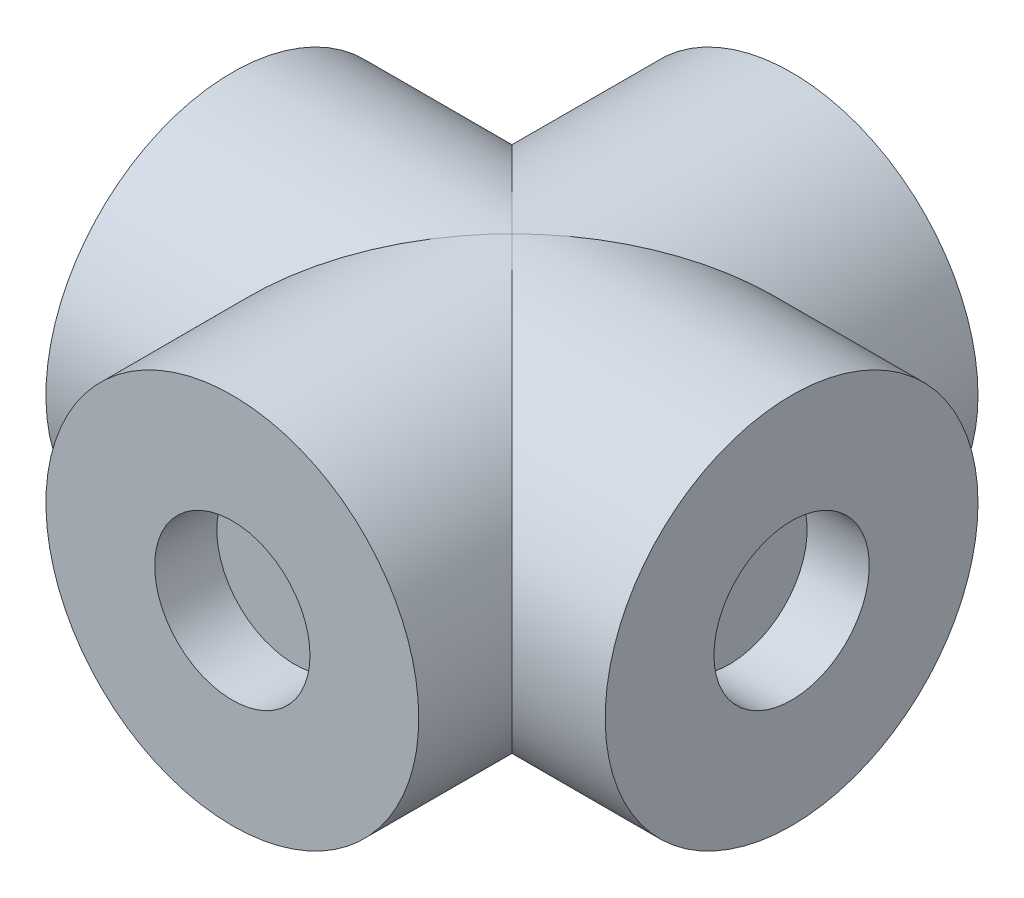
ISO-10303-21;
HEADER;
FILE_DESCRIPTION(('STEP AP214'),'2;1');
FILE_NAME('part.step','',(''),(''),'','','');
FILE_SCHEMA(('AUTOMOTIVE_DESIGN { 1 0 10303 214 1 1 1 1 }'));
ENDSEC;
DATA;
#1=APPLICATION_CONTEXT('core data for automotive mechanical design processes');
#2=APPLICATION_PROTOCOL_DEFINITION('international standard','automotive_design',2000,#1);
#3=PRODUCT_CONTEXT('',#1,'mechanical');
#4=PRODUCT('Part','Part','',(#3));
#5=PRODUCT_RELATED_PRODUCT_CATEGORY('part','',(#4));
#6=PRODUCT_DEFINITION_FORMATION('','',#4);
#7=PRODUCT_DEFINITION_CONTEXT('part definition',#1,'design');
#8=PRODUCT_DEFINITION('design','',#6,#7);
#9=PRODUCT_DEFINITION_SHAPE('','',#8);
#10=(LENGTH_UNIT() NAMED_UNIT(*) SI_UNIT(.MILLI.,.METRE.));
#11=(NAMED_UNIT(*) PLANE_ANGLE_UNIT() SI_UNIT($,.RADIAN.));
#12=(NAMED_UNIT(*) SI_UNIT($,.STERADIAN.) SOLID_ANGLE_UNIT());
#13=UNCERTAINTY_MEASURE_WITH_UNIT(LENGTH_MEASURE(1.E-05),#10,'distance_accuracy_value','');
#14=(GEOMETRIC_REPRESENTATION_CONTEXT(3) GLOBAL_UNCERTAINTY_ASSIGNED_CONTEXT((#13)) GLOBAL_UNIT_ASSIGNED_CONTEXT((#10,
#11,#12)) REPRESENTATION_CONTEXT('',''));
#15=CARTESIAN_POINT('',(0.,0.,0.));
#16=DIRECTION('',(0.,0.,1.));
#17=DIRECTION('',(1.,0.,0.));
#18=AXIS2_PLACEMENT_3D('',#15,#16,#17);
#19=CARTESIAN_POINT('',(0.,0.,45.));
#20=DIRECTION('',(0.,0.,-1.));
#21=DIRECTION('',(-1.,0.,0.));
#22=AXIS2_PLACEMENT_3D('',#19,#20,#21);
#23=CYLINDRICAL_SURFACE('',#22,30.);
#24=CARTESIAN_POINT('',(0.,0.,45.));
#25=DIRECTION('',(0.,0.,1.));
#26=DIRECTION('',(1.,0.,0.));
#27=AXIS2_PLACEMENT_3D('',#24,#25,#26);
#28=CIRCLE('',#27,30.);
#29=CARTESIAN_POINT('',(30.,0.,45.));
#30=VERTEX_POINT('',#29);
#31=EDGE_CURVE('E59',#30,#30,#28,.T.);
#32=ORIENTED_EDGE('',*,*,#31,.F.);
#33=EDGE_LOOP('',(#32));
#34=FACE_BOUND('',#33,.T.);
#35=CARTESIAN_POINT('',(0.,0.,0.));
#36=DIRECTION('',(-0.707106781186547,0.,-0.707106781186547));
#37=DIRECTION('',(0.707106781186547,0.,-0.707106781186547));
#38=AXIS2_PLACEMENT_3D('',#35,#36,#37);
#39=ELLIPSE('',#38,42.4264068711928,30.);
#40=CARTESIAN_POINT('',(0.,-30.,0.));
#41=VERTEX_POINT('',#40);
#42=CARTESIAN_POINT('',(0.,30.,0.));
#43=VERTEX_POINT('',#42);
#44=EDGE_CURVE('E43',#41,#43,#39,.T.);
#45=ORIENTED_EDGE('',*,*,#44,.F.);
#46=CARTESIAN_POINT('',(0.,0.,0.));
#47=DIRECTION('',(0.707106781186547,0.,-0.707106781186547));
#48=DIRECTION('',(-0.707106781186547,0.,-0.707106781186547));
#49=AXIS2_PLACEMENT_3D('',#46,#47,#48);
#50=ELLIPSE('',#49,42.4264068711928,30.);
#51=EDGE_CURVE('E55',#43,#41,#50,.T.);
#52=ORIENTED_EDGE('',*,*,#51,.F.);
#53=EDGE_LOOP('',(#45,#52));
#54=FACE_BOUND('',#53,.T.);
#55=ADVANCED_FACE('F35',(#34,#54),#23,.T.);
#56=CARTESIAN_POINT('',(0.,0.,45.));
#57=DIRECTION('',(0.,0.,1.));
#58=DIRECTION('',(1.,0.,0.));
#59=AXIS2_PLACEMENT_3D('',#56,#57,#58);
#60=PLANE('',#59);
#61=CARTESIAN_POINT('',(0.,0.,45.));
#62=DIRECTION('',(0.,0.,1.));
#63=DIRECTION('',(1.,0.,0.));
#64=AXIS2_PLACEMENT_3D('',#61,#62,#63);
#65=CIRCLE('',#64,12.5);
#66=CARTESIAN_POINT('',(12.5,0.,45.));
#67=VERTEX_POINT('',#66);
#68=EDGE_CURVE('E101',#67,#67,#65,.T.);
#69=ORIENTED_EDGE('',*,*,#68,.F.);
#70=EDGE_LOOP('',(#69));
#71=FACE_BOUND('',#70,.T.);
#72=ORIENTED_EDGE('',*,*,#31,.T.);
#73=EDGE_LOOP('',(#72));
#74=FACE_BOUND('',#73,.T.);
#75=ADVANCED_FACE('F84',(#71,#74),#60,.T.);
#76=CARTESIAN_POINT('',(0.,0.,35.));
#77=DIRECTION('',(0.,0.,1.));
#78=DIRECTION('',(1.,0.,0.));
#79=AXIS2_PLACEMENT_3D('',#76,#77,#78);
#80=CYLINDRICAL_SURFACE('',#79,12.5);
#81=CARTESIAN_POINT('',(0.,0.,35.));
#82=DIRECTION('',(0.,0.,1.));
#83=DIRECTION('',(1.,0.,0.));
#84=AXIS2_PLACEMENT_3D('',#81,#82,#83);
#85=CIRCLE('',#84,12.5);
#86=CARTESIAN_POINT('',(12.5,0.,35.));
#87=VERTEX_POINT('',#86);
#88=EDGE_CURVE('E98',#87,#87,#85,.T.);
#89=ORIENTED_EDGE('',*,*,#88,.F.);
#90=EDGE_LOOP('',(#89));
#91=FACE_BOUND('',#90,.T.);
#92=ORIENTED_EDGE('',*,*,#68,.T.);
#93=EDGE_LOOP('',(#92));
#94=FACE_BOUND('',#93,.T.);
#95=ADVANCED_FACE('F89',(#91,#94),#80,.F.);
#96=CARTESIAN_POINT('',(0.,0.,35.));
#97=DIRECTION('',(0.,0.,1.));
#98=DIRECTION('',(1.,0.,0.));
#99=AXIS2_PLACEMENT_3D('',#96,#97,#98);
#100=PLANE('',#99);
#101=ORIENTED_EDGE('',*,*,#88,.T.);
#102=EDGE_LOOP('',(#101));
#103=FACE_BOUND('',#102,.T.);
#104=ADVANCED_FACE('F149',(#103),#100,.T.);
#105=CARTESIAN_POINT('',(-45.,0.,0.));
#106=DIRECTION('',(1.,0.,0.));
#107=DIRECTION('',(0.,0.,-1.));
#108=AXIS2_PLACEMENT_3D('',#105,#106,#107);
#109=PLANE('',#108);
#110=CARTESIAN_POINT('',(-45.,0.,0.));
#111=DIRECTION('',(-1.,0.,0.));
#112=DIRECTION('',(0.,0.,1.));
#113=AXIS2_PLACEMENT_3D('',#110,#111,#112);
#114=CIRCLE('',#113,12.5);
#115=CARTESIAN_POINT('',(-45.,0.,12.5));
#116=VERTEX_POINT('',#115);
#117=EDGE_CURVE('E119',#116,#116,#114,.T.);
#118=ORIENTED_EDGE('',*,*,#117,.F.);
#119=EDGE_LOOP('',(#118));
#120=FACE_BOUND('',#119,.T.);
#121=CARTESIAN_POINT('',(-45.,0.,0.));
#122=DIRECTION('',(1.,0.,0.));
#123=DIRECTION('',(0.,0.,-1.));
#124=AXIS2_PLACEMENT_3D('',#121,#122,#123);
#125=CIRCLE('',#124,30.);
#126=CARTESIAN_POINT('',(-45.,0.,-30.));
#127=VERTEX_POINT('',#126);
#128=EDGE_CURVE('E113',#127,#127,#125,.T.);
#129=ORIENTED_EDGE('',*,*,#128,.F.);
#130=EDGE_LOOP('',(#129));
#131=FACE_BOUND('',#130,.T.);
#132=ADVANCED_FACE('F81',(#120,#131),#109,.F.);
#133=CARTESIAN_POINT('',(45.,0.,0.));
#134=DIRECTION('',(-1.,0.,0.));
#135=DIRECTION('',(0.,0.,1.));
#136=AXIS2_PLACEMENT_3D('',#133,#134,#135);
#137=CYLINDRICAL_SURFACE('',#136,30.);
#138=ORIENTED_EDGE('',*,*,#128,.T.);
#139=EDGE_LOOP('',(#138));
#140=FACE_BOUND('',#139,.T.);
#141=CARTESIAN_POINT('',(0.,0.,0.));
#142=DIRECTION('',(0.707106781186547,0.,-0.707106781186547));
#143=DIRECTION('',(-0.707106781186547,0.,-0.707106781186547));
#144=AXIS2_PLACEMENT_3D('',#141,#142,#143);
#145=ELLIPSE('',#144,42.4264068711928,30.);
#146=EDGE_CURVE('E49',#43,#41,#145,.F.);
#147=ORIENTED_EDGE('',*,*,#146,.T.);
#148=ORIENTED_EDGE('',*,*,#44,.T.);
#149=EDGE_LOOP('',(#147,#148));
#150=FACE_BOUND('',#149,.T.);
#151=ADVANCED_FACE('F61',(#140,#150),#137,.T.);
#152=CARTESIAN_POINT('',(0.,0.,-35.));
#153=DIRECTION('',(0.,0.,-1.));
#154=DIRECTION('',(1.,0.,0.));
#155=AXIS2_PLACEMENT_3D('',#152,#153,#154);
#156=PLANE('',#155);
#157=CARTESIAN_POINT('',(0.,0.,-35.));
#158=DIRECTION('',(0.,0.,1.));
#159=DIRECTION('',(1.,0.,0.));
#160=AXIS2_PLACEMENT_3D('',#157,#158,#159);
#161=CIRCLE('',#160,12.5);
#162=CARTESIAN_POINT('',(12.5,0.,-35.));
#163=VERTEX_POINT('',#162);
#164=EDGE_CURVE('E104',#163,#163,#161,.T.);
#165=ORIENTED_EDGE('',*,*,#164,.F.);
#166=EDGE_LOOP('',(#165));
#167=FACE_BOUND('',#166,.T.);
#168=ADVANCED_FACE('F80',(#167),#156,.T.);
#169=CARTESIAN_POINT('',(0.,0.,-35.));
#170=DIRECTION('',(0.,0.,-1.));
#171=DIRECTION('',(-1.,0.,0.));
#172=AXIS2_PLACEMENT_3D('',#169,#170,#171);
#173=CYLINDRICAL_SURFACE('',#172,12.5);
#174=ORIENTED_EDGE('',*,*,#164,.T.);
#175=EDGE_LOOP('',(#174));
#176=FACE_BOUND('',#175,.T.);
#177=CARTESIAN_POINT('',(0.,0.,-45.));
#178=DIRECTION('',(0.,0.,1.));
#179=DIRECTION('',(1.,0.,0.));
#180=AXIS2_PLACEMENT_3D('',#177,#178,#179);
#181=CIRCLE('',#180,12.5);
#182=CARTESIAN_POINT('',(12.5,0.,-45.));
#183=VERTEX_POINT('',#182);
#184=EDGE_CURVE('E107',#183,#183,#181,.T.);
#185=ORIENTED_EDGE('',*,*,#184,.F.);
#186=EDGE_LOOP('',(#185));
#187=FACE_BOUND('',#186,.T.);
#188=ADVANCED_FACE('F166',(#176,#187),#173,.F.);
#189=CARTESIAN_POINT('',(0.,0.,-45.));
#190=DIRECTION('',(0.,0.,1.));
#191=DIRECTION('',(1.,0.,0.));
#192=AXIS2_PLACEMENT_3D('',#189,#190,#191);
#193=PLANE('',#192);
#194=ORIENTED_EDGE('',*,*,#184,.T.);
#195=EDGE_LOOP('',(#194));
#196=FACE_BOUND('',#195,.T.);
#197=CARTESIAN_POINT('',(0.,0.,-45.));
#198=DIRECTION('',(0.,0.,1.));
#199=DIRECTION('',(1.,0.,0.));
#200=AXIS2_PLACEMENT_3D('',#197,#198,#199);
#201=CIRCLE('',#200,30.);
#202=CARTESIAN_POINT('',(30.,0.,-45.));
#203=VERTEX_POINT('',#202);
#204=EDGE_CURVE('E95',#203,#203,#201,.T.);
#205=ORIENTED_EDGE('',*,*,#204,.F.);
#206=EDGE_LOOP('',(#205));
#207=FACE_BOUND('',#206,.T.);
#208=ADVANCED_FACE('F74',(#196,#207),#193,.F.);
#209=ORIENTED_EDGE('',*,*,#204,.T.);
#210=EDGE_LOOP('',(#209));
#211=FACE_BOUND('',#210,.T.);
#212=CARTESIAN_POINT('',(0.,0.,0.));
#213=DIRECTION('',(-0.707106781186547,0.,-0.707106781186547));
#214=DIRECTION('',(0.707106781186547,0.,-0.707106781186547));
#215=AXIS2_PLACEMENT_3D('',#212,#213,#214);
#216=ELLIPSE('',#215,42.4264068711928,30.);
#217=EDGE_CURVE('E11',#41,#43,#216,.F.);
#218=ORIENTED_EDGE('',*,*,#217,.F.);
#219=ORIENTED_EDGE('',*,*,#146,.F.);
#220=EDGE_LOOP('',(#218,#219));
#221=FACE_BOUND('',#220,.T.);
#222=ADVANCED_FACE('F37',(#211,#221),#23,.T.);
#223=CARTESIAN_POINT('',(45.,0.,0.));
#224=DIRECTION('',(1.,0.,0.));
#225=DIRECTION('',(0.,0.,-1.));
#226=AXIS2_PLACEMENT_3D('',#223,#224,#225);
#227=CIRCLE('',#226,30.);
#228=CARTESIAN_POINT('',(45.,0.,-30.));
#229=VERTEX_POINT('',#228);
#230=EDGE_CURVE('E110',#229,#229,#227,.T.);
#231=ORIENTED_EDGE('',*,*,#230,.F.);
#232=EDGE_LOOP('',(#231));
#233=FACE_BOUND('',#232,.T.);
#234=ORIENTED_EDGE('',*,*,#51,.T.);
#235=ORIENTED_EDGE('',*,*,#217,.T.);
#236=EDGE_LOOP('',(#234,#235));
#237=FACE_BOUND('',#236,.T.);
#238=ADVANCED_FACE('F62',(#233,#237),#137,.T.);
#239=CARTESIAN_POINT('',(45.,0.,0.));
#240=DIRECTION('',(1.,0.,0.));
#241=DIRECTION('',(0.,0.,-1.));
#242=AXIS2_PLACEMENT_3D('',#239,#240,#241);
#243=PLANE('',#242);
#244=CARTESIAN_POINT('',(45.,0.,0.));
#245=DIRECTION('',(-1.,0.,0.));
#246=DIRECTION('',(0.,0.,1.));
#247=AXIS2_PLACEMENT_3D('',#244,#245,#246);
#248=CIRCLE('',#247,12.5);
#249=CARTESIAN_POINT('',(45.,0.,12.5));
#250=VERTEX_POINT('',#249);
#251=EDGE_CURVE('E125',#250,#250,#248,.T.);
#252=ORIENTED_EDGE('',*,*,#251,.T.);
#253=EDGE_LOOP('',(#252));
#254=FACE_BOUND('',#253,.T.);
#255=ORIENTED_EDGE('',*,*,#230,.T.);
#256=EDGE_LOOP('',(#255));
#257=FACE_BOUND('',#256,.T.);
#258=ADVANCED_FACE('F64',(#254,#257),#243,.T.);
#259=CARTESIAN_POINT('',(-35.,0.,0.));
#260=DIRECTION('',(-1.,0.,0.));
#261=DIRECTION('',(0.,0.,1.));
#262=AXIS2_PLACEMENT_3D('',#259,#260,#261);
#263=CYLINDRICAL_SURFACE('',#262,12.5);
#264=CARTESIAN_POINT('',(-35.,0.,0.));
#265=DIRECTION('',(-1.,0.,0.));
#266=DIRECTION('',(0.,0.,1.));
#267=AXIS2_PLACEMENT_3D('',#264,#265,#266);
#268=CIRCLE('',#267,12.5);
#269=CARTESIAN_POINT('',(-35.,0.,12.5));
#270=VERTEX_POINT('',#269);
#271=EDGE_CURVE('E116',#270,#270,#268,.T.);
#272=ORIENTED_EDGE('',*,*,#271,.F.);
#273=EDGE_LOOP('',(#272));
#274=FACE_BOUND('',#273,.T.);
#275=ORIENTED_EDGE('',*,*,#117,.T.);
#276=EDGE_LOOP('',(#275));
#277=FACE_BOUND('',#276,.T.);
#278=ADVANCED_FACE('F71',(#274,#277),#263,.F.);
#279=CARTESIAN_POINT('',(-35.,0.,0.));
#280=DIRECTION('',(-1.,0.,0.));
#281=DIRECTION('',(0.,0.,1.));
#282=AXIS2_PLACEMENT_3D('',#279,#280,#281);
#283=PLANE('',#282);
#284=ORIENTED_EDGE('',*,*,#271,.T.);
#285=EDGE_LOOP('',(#284));
#286=FACE_BOUND('',#285,.T.);
#287=ADVANCED_FACE('F140',(#286),#283,.T.);
#288=CARTESIAN_POINT('',(35.,0.,0.));
#289=DIRECTION('',(1.,0.,0.));
#290=DIRECTION('',(0.,0.,-1.));
#291=AXIS2_PLACEMENT_3D('',#288,#289,#290);
#292=CYLINDRICAL_SURFACE('',#291,12.5);
#293=CARTESIAN_POINT('',(35.,0.,0.));
#294=DIRECTION('',(-1.,0.,0.));
#295=DIRECTION('',(0.,0.,1.));
#296=AXIS2_PLACEMENT_3D('',#293,#294,#295);
#297=CIRCLE('',#296,12.5);
#298=CARTESIAN_POINT('',(35.,0.,12.5));
#299=VERTEX_POINT('',#298);
#300=EDGE_CURVE('E122',#299,#299,#297,.T.);
#301=ORIENTED_EDGE('',*,*,#300,.T.);
#302=EDGE_LOOP('',(#301));
#303=FACE_BOUND('',#302,.T.);
#304=ORIENTED_EDGE('',*,*,#251,.F.);
#305=EDGE_LOOP('',(#304));
#306=FACE_BOUND('',#305,.T.);
#307=ADVANCED_FACE('F131',(#303,#306),#292,.F.);
#308=CARTESIAN_POINT('',(35.,0.,0.));
#309=DIRECTION('',(1.,0.,0.));
#310=DIRECTION('',(0.,0.,1.));
#311=AXIS2_PLACEMENT_3D('',#308,#309,#310);
#312=PLANE('',#311);
#313=ORIENTED_EDGE('',*,*,#300,.F.);
#314=EDGE_LOOP('',(#313));
#315=FACE_BOUND('',#314,.T.);
#316=ADVANCED_FACE('F134',(#315),#312,.T.);
#317=CLOSED_SHELL('',(#55,#75,#95,#104,#132,#151,#168,#188,#208,#222,#238,#258,#278,#287,#307,#316));
#318=MANIFOLD_SOLID_BREP('B2',#317);
#319=ADVANCED_BREP_SHAPE_REPRESENTATION('',(#18,#318),#14);
#320=SHAPE_DEFINITION_REPRESENTATION(#9,#319);
ENDSEC;
END-ISO-10303-21;
